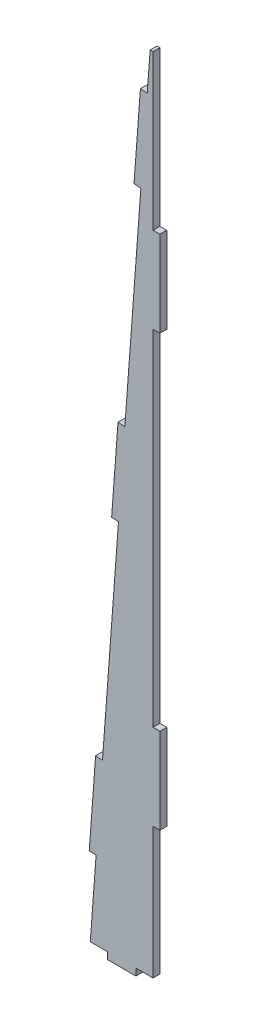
ISO-10303-21;
HEADER;
FILE_DESCRIPTION(('STEP AP214'),'2;1');
FILE_NAME('part.step','',(''),(''),'','','');
FILE_SCHEMA(('AUTOMOTIVE_DESIGN { 1 0 10303 214 1 1 1 1 }'));
ENDSEC;
DATA;
#1=APPLICATION_CONTEXT('core data for automotive mechanical design processes');
#2=APPLICATION_PROTOCOL_DEFINITION('international standard','automotive_design',2000,#1);
#3=PRODUCT_CONTEXT('',#1,'mechanical');
#4=PRODUCT('Part','Part','',(#3));
#5=PRODUCT_RELATED_PRODUCT_CATEGORY('part','',(#4));
#6=PRODUCT_DEFINITION_FORMATION('','',#4);
#7=PRODUCT_DEFINITION_CONTEXT('part definition',#1,'design');
#8=PRODUCT_DEFINITION('design','',#6,#7);
#9=PRODUCT_DEFINITION_SHAPE('','',#8);
#10=(LENGTH_UNIT() NAMED_UNIT(*) SI_UNIT(.MILLI.,.METRE.));
#11=(NAMED_UNIT(*) PLANE_ANGLE_UNIT() SI_UNIT($,.RADIAN.));
#12=(NAMED_UNIT(*) SI_UNIT($,.STERADIAN.) SOLID_ANGLE_UNIT());
#13=UNCERTAINTY_MEASURE_WITH_UNIT(LENGTH_MEASURE(1.E-05),#10,'distance_accuracy_value','');
#14=(GEOMETRIC_REPRESENTATION_CONTEXT(3) GLOBAL_UNCERTAINTY_ASSIGNED_CONTEXT((#13)) GLOBAL_UNIT_ASSIGNED_CONTEXT((#10,
#11,#12)) REPRESENTATION_CONTEXT('',''));
#15=CARTESIAN_POINT('',(0.,0.,0.));
#16=DIRECTION('',(0.,0.,1.));
#17=DIRECTION('',(1.,0.,0.));
#18=AXIS2_PLACEMENT_3D('',#15,#16,#17);
#19=CARTESIAN_POINT('',(-1.52399999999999,179.876556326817,1.524));
#20=DIRECTION('',(-1.,0.,0.));
#21=DIRECTION('',(0.,0.,1.));
#22=AXIS2_PLACEMENT_3D('',#19,#20,#21);
#23=PLANE('',#22);
#24=DIRECTION('',(0.,1.,0.));
#25=VECTOR('',#24,1.);
#26=CARTESIAN_POINT('',(-1.52399999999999,179.876556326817,0.));
#27=LINE('',#26,#25);
#28=CARTESIAN_POINT('',(-1.52399999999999,145.513267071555,0.));
#29=VERTEX_POINT('',#28);
#30=CARTESIAN_POINT('',(-1.52399999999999,179.876556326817,0.));
#31=VERTEX_POINT('',#30);
#32=EDGE_CURVE('E252',#29,#31,#27,.T.);
#33=ORIENTED_EDGE('',*,*,#32,.T.);
#34=DIRECTION('',(0.,0.,-1.));
#35=VECTOR('',#34,1.);
#36=CARTESIAN_POINT('',(-1.52399999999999,179.876556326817,1.524));
#37=LINE('',#36,#35);
#38=CARTESIAN_POINT('',(-1.52399999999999,179.876556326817,1.524));
#39=VERTEX_POINT('',#38);
#40=EDGE_CURVE('E11',#39,#31,#37,.T.);
#41=ORIENTED_EDGE('',*,*,#40,.F.);
#42=DIRECTION('',(0.,1.,0.));
#43=VECTOR('',#42,1.);
#44=CARTESIAN_POINT('',(-1.52399999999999,179.876556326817,1.524));
#45=LINE('',#44,#43);
#46=CARTESIAN_POINT('',(-1.52399999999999,145.513267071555,1.524));
#47=VERTEX_POINT('',#46);
#48=EDGE_CURVE('E306',#47,#39,#45,.T.);
#49=ORIENTED_EDGE('',*,*,#48,.F.);
#50=DIRECTION('',(0.,0.,-1.));
#51=VECTOR('',#50,1.);
#52=CARTESIAN_POINT('',(-1.52399999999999,145.513267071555,1.524));
#53=LINE('',#52,#51);
#54=EDGE_CURVE('E248',#47,#29,#53,.T.);
#55=ORIENTED_EDGE('',*,*,#54,.T.);
#56=EDGE_LOOP('',(#33,#41,#49,#55));
#57=FACE_BOUND('',#56,.T.);
#58=ADVANCED_FACE('F36',(#57),#23,.F.);
#59=CARTESIAN_POINT('',(-2.16867137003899,179.876556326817,1.524));
#60=DIRECTION('',(0.,-1.,0.));
#61=DIRECTION('',(0.,0.,-1.));
#62=AXIS2_PLACEMENT_3D('',#59,#60,#61);
#63=PLANE('',#62);
#64=DIRECTION('',(-1.,0.,0.));
#65=VECTOR('',#64,1.);
#66=CARTESIAN_POINT('',(-2.16867137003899,179.876556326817,0.));
#67=LINE('',#66,#65);
#68=CARTESIAN_POINT('',(-2.16867137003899,179.876556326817,0.));
#69=VERTEX_POINT('',#68);
#70=EDGE_CURVE('E255',#31,#69,#67,.T.);
#71=ORIENTED_EDGE('',*,*,#70,.T.);
#72=DIRECTION('',(0.,0.,-1.));
#73=VECTOR('',#72,1.);
#74=CARTESIAN_POINT('',(-2.16867137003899,179.876556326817,1.524));
#75=LINE('',#74,#73);
#76=CARTESIAN_POINT('',(-2.16867137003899,179.876556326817,1.524));
#77=VERTEX_POINT('',#76);
#78=EDGE_CURVE('E44',#77,#69,#75,.T.);
#79=ORIENTED_EDGE('',*,*,#78,.F.);
#80=DIRECTION('',(-1.,0.,0.));
#81=VECTOR('',#80,1.);
#82=CARTESIAN_POINT('',(-2.16867137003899,179.876556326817,1.524));
#83=LINE('',#82,#81);
#84=EDGE_CURVE('E155',#39,#77,#83,.T.);
#85=ORIENTED_EDGE('',*,*,#84,.F.);
#86=ORIENTED_EDGE('',*,*,#40,.T.);
#87=EDGE_LOOP('',(#71,#79,#85,#86));
#88=FACE_BOUND('',#87,.T.);
#89=ADVANCED_FACE('F464',(#88),#63,.F.);
#90=CARTESIAN_POINT('',(-2.813342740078,171.236165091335,1.524));
#91=DIRECTION('',(0.997228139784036,-0.0744045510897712,0.));
#92=DIRECTION('',(0.0744045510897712,0.997228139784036,0.));
#93=AXIS2_PLACEMENT_3D('',#90,#91,#92);
#94=PLANE('',#93);
#95=DIRECTION('',(-0.0744045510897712,-0.997228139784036,0.));
#96=VECTOR('',#95,1.);
#97=CARTESIAN_POINT('',(-2.813342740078,171.236165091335,0.));
#98=LINE('',#97,#96);
#99=CARTESIAN_POINT('',(-2.813342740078,171.236165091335,0.));
#100=VERTEX_POINT('',#99);
#101=EDGE_CURVE('E257',#69,#100,#98,.T.);
#102=ORIENTED_EDGE('',*,*,#101,.T.);
#103=DIRECTION('',(0.,0.,-1.));
#104=VECTOR('',#103,1.);
#105=CARTESIAN_POINT('',(-2.813342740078,171.236165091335,1.524));
#106=LINE('',#105,#104);
#107=CARTESIAN_POINT('',(-2.813342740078,171.236165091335,1.524));
#108=VERTEX_POINT('',#107);
#109=EDGE_CURVE('E373',#108,#100,#106,.T.);
#110=ORIENTED_EDGE('',*,*,#109,.F.);
#111=DIRECTION('',(-0.0744045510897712,-0.997228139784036,0.));
#112=VECTOR('',#111,1.);
#113=CARTESIAN_POINT('',(-2.813342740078,171.236165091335,1.524));
#114=LINE('',#113,#112);
#115=EDGE_CURVE('E381',#77,#108,#114,.T.);
#116=ORIENTED_EDGE('',*,*,#115,.F.);
#117=ORIENTED_EDGE('',*,*,#78,.T.);
#118=EDGE_LOOP('',(#102,#110,#116,#117));
#119=FACE_BOUND('',#118,.T.);
#120=ADVANCED_FACE('F379',(#119),#94,.F.);
#121=CARTESIAN_POINT('',(-2.813342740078,171.236165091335,1.524));
#122=DIRECTION('',(-0.0744045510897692,-0.997228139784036,0.));
#123=DIRECTION('',(0.997228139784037,-0.0744045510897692,0.));
#124=AXIS2_PLACEMENT_3D('',#121,#122,#123);
#125=PLANE('',#124);
#126=DIRECTION('',(-0.997228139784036,0.0744045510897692,0.));
#127=VECTOR('',#126,1.);
#128=CARTESIAN_POINT('',(-2.813342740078,171.236165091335,0.));
#129=LINE('',#128,#127);
#130=CARTESIAN_POINT('',(-4.33311842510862,171.349557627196,0.));
#131=VERTEX_POINT('',#130);
#132=EDGE_CURVE('E259',#100,#131,#129,.T.);
#133=ORIENTED_EDGE('',*,*,#132,.T.);
#134=DIRECTION('',(0.,0.,-1.));
#135=VECTOR('',#134,1.);
#136=CARTESIAN_POINT('',(-4.33311842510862,171.349557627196,1.524));
#137=LINE('',#136,#135);
#138=CARTESIAN_POINT('',(-4.33311842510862,171.349557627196,1.524));
#139=VERTEX_POINT('',#138);
#140=EDGE_CURVE('E370',#139,#131,#137,.T.);
#141=ORIENTED_EDGE('',*,*,#140,.F.);
#142=DIRECTION('',(-0.997228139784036,0.0744045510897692,0.));
#143=VECTOR('',#142,1.);
#144=CARTESIAN_POINT('',(-2.813342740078,171.236165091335,1.524));
#145=LINE('',#144,#143);
#146=EDGE_CURVE('E399',#108,#139,#145,.T.);
#147=ORIENTED_EDGE('',*,*,#146,.F.);
#148=ORIENTED_EDGE('',*,*,#109,.T.);
#149=EDGE_LOOP('',(#133,#141,#147,#148));
#150=FACE_BOUND('',#149,.T.);
#151=ADVANCED_FACE('F390',(#150),#125,.F.);
#152=CARTESIAN_POINT('',(-5.75052512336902,152.35236156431,1.524));
#153=DIRECTION('',(0.997228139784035,-0.0744045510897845,0.));
#154=DIRECTION('',(0.0744045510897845,0.997228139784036,0.));
#155=AXIS2_PLACEMENT_3D('',#152,#153,#154);
#156=PLANE('',#155);
#157=DIRECTION('',(-0.0744045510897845,-0.997228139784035,0.));
#158=VECTOR('',#157,1.);
#159=CARTESIAN_POINT('',(-5.75052512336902,152.35236156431,0.));
#160=LINE('',#159,#158);
#161=CARTESIAN_POINT('',(-5.75052512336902,152.35236156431,0.));
#162=VERTEX_POINT('',#161);
#163=EDGE_CURVE('E261',#131,#162,#160,.T.);
#164=ORIENTED_EDGE('',*,*,#163,.T.);
#165=DIRECTION('',(0.,0.,-1.));
#166=VECTOR('',#165,1.);
#167=CARTESIAN_POINT('',(-5.75052512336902,152.35236156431,1.524));
#168=LINE('',#167,#166);
#169=CARTESIAN_POINT('',(-5.75052512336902,152.35236156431,1.524));
#170=VERTEX_POINT('',#169);
#171=EDGE_CURVE('E367',#170,#162,#168,.T.);
#172=ORIENTED_EDGE('',*,*,#171,.F.);
#173=DIRECTION('',(-0.0744045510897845,-0.997228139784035,0.));
#174=VECTOR('',#173,1.);
#175=CARTESIAN_POINT('',(-5.75052512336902,152.35236156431,1.524));
#176=LINE('',#175,#174);
#177=EDGE_CURVE('E396',#139,#170,#176,.T.);
#178=ORIENTED_EDGE('',*,*,#177,.F.);
#179=ORIENTED_EDGE('',*,*,#140,.T.);
#180=EDGE_LOOP('',(#164,#172,#178,#179));
#181=FACE_BOUND('',#180,.T.);
#182=ADVANCED_FACE('F394',(#181),#156,.F.);
#183=CARTESIAN_POINT('',(-4.23074943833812,152.238969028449,1.524));
#184=DIRECTION('',(0.0744045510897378,0.997228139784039,0.));
#185=DIRECTION('',(-0.997228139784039,0.0744045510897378,0.));
#186=AXIS2_PLACEMENT_3D('',#183,#184,#185);
#187=PLANE('',#186);
#188=DIRECTION('',(0.997228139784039,-0.0744045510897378,0.));
#189=VECTOR('',#188,1.);
#190=CARTESIAN_POINT('',(-4.23074943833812,152.238969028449,0.));
#191=LINE('',#190,#189);
#192=CARTESIAN_POINT('',(-4.23074943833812,152.238969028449,0.));
#193=VERTEX_POINT('',#192);
#194=EDGE_CURVE('E263',#162,#193,#191,.T.);
#195=ORIENTED_EDGE('',*,*,#194,.T.);
#196=DIRECTION('',(0.,0.,-1.));
#197=VECTOR('',#196,1.);
#198=CARTESIAN_POINT('',(-4.23074943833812,152.238969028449,1.524));
#199=LINE('',#198,#197);
#200=CARTESIAN_POINT('',(-4.23074943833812,152.238969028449,1.524));
#201=VERTEX_POINT('',#200);
#202=EDGE_CURVE('E364',#201,#193,#199,.T.);
#203=ORIENTED_EDGE('',*,*,#202,.F.);
#204=DIRECTION('',(0.997228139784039,-0.0744045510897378,0.));
#205=VECTOR('',#204,1.);
#206=CARTESIAN_POINT('',(-4.23074943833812,152.238969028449,1.524));
#207=LINE('',#206,#205);
#208=EDGE_CURVE('E398',#170,#201,#207,.T.);
#209=ORIENTED_EDGE('',*,*,#208,.F.);
#210=ORIENTED_EDGE('',*,*,#171,.T.);
#211=EDGE_LOOP('',(#195,#203,#209,#210));
#212=FACE_BOUND('',#211,.T.);
#213=ADVANCED_FACE('F477',(#212),#187,.F.);
#214=CARTESIAN_POINT('',(-7.78613110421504,104.586955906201,1.524));
#215=DIRECTION('',(0.997228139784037,-0.0744045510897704,0.));
#216=DIRECTION('',(0.0744045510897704,0.997228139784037,0.));
#217=AXIS2_PLACEMENT_3D('',#214,#215,#216);
#218=PLANE('',#217);
#219=DIRECTION('',(-0.0744045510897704,-0.997228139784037,0.));
#220=VECTOR('',#219,1.);
#221=CARTESIAN_POINT('',(-7.78613110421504,104.586955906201,0.));
#222=LINE('',#221,#220);
#223=CARTESIAN_POINT('',(-7.78613110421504,104.586955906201,0.));
#224=VERTEX_POINT('',#223);
#225=EDGE_CURVE('E265',#193,#224,#222,.T.);
#226=ORIENTED_EDGE('',*,*,#225,.T.);
#227=DIRECTION('',(0.,0.,-1.));
#228=VECTOR('',#227,1.);
#229=CARTESIAN_POINT('',(-7.78613110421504,104.586955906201,1.524));
#230=LINE('',#229,#228);
#231=CARTESIAN_POINT('',(-7.78613110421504,104.586955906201,1.524));
#232=VERTEX_POINT('',#231);
#233=EDGE_CURVE('E361',#232,#224,#230,.T.);
#234=ORIENTED_EDGE('',*,*,#233,.F.);
#235=DIRECTION('',(-0.0744045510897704,-0.997228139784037,0.));
#236=VECTOR('',#235,1.);
#237=CARTESIAN_POINT('',(-7.78613110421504,104.586955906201,1.524));
#238=LINE('',#237,#236);
#239=EDGE_CURVE('E401',#201,#232,#238,.T.);
#240=ORIENTED_EDGE('',*,*,#239,.F.);
#241=ORIENTED_EDGE('',*,*,#202,.T.);
#242=EDGE_LOOP('',(#226,#234,#240,#241));
#243=FACE_BOUND('',#242,.T.);
#244=ADVANCED_FACE('F480',(#243),#218,.F.);
#245=CARTESIAN_POINT('',(-7.78613110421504,104.586955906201,1.524));
#246=DIRECTION('',(-0.0744045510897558,-0.997228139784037,0.));
#247=DIRECTION('',(0.997228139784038,-0.0744045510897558,0.));
#248=AXIS2_PLACEMENT_3D('',#245,#246,#247);
#249=PLANE('',#248);
#250=DIRECTION('',(-0.997228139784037,0.0744045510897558,0.));
#251=VECTOR('',#250,1.);
#252=CARTESIAN_POINT('',(-7.78613110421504,104.586955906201,0.));
#253=LINE('',#252,#251);
#254=CARTESIAN_POINT('',(-9.30590678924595,104.700348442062,0.));
#255=VERTEX_POINT('',#254);
#256=EDGE_CURVE('E267',#224,#255,#253,.T.);
#257=ORIENTED_EDGE('',*,*,#256,.T.);
#258=DIRECTION('',(0.,0.,-1.));
#259=VECTOR('',#258,1.);
#260=CARTESIAN_POINT('',(-9.30590678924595,104.700348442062,1.524));
#261=LINE('',#260,#259);
#262=CARTESIAN_POINT('',(-9.30590678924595,104.700348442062,1.524));
#263=VERTEX_POINT('',#262);
#264=EDGE_CURVE('E358',#263,#255,#261,.T.);
#265=ORIENTED_EDGE('',*,*,#264,.F.);
#266=DIRECTION('',(-0.997228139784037,0.0744045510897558,0.));
#267=VECTOR('',#266,1.);
#268=CARTESIAN_POINT('',(-7.78613110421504,104.586955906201,1.524));
#269=LINE('',#268,#267);
#270=EDGE_CURVE('E407',#232,#263,#269,.T.);
#271=ORIENTED_EDGE('',*,*,#270,.F.);
#272=ORIENTED_EDGE('',*,*,#233,.T.);
#273=EDGE_LOOP('',(#257,#265,#271,#272));
#274=FACE_BOUND('',#273,.T.);
#275=ADVANCED_FACE('F484',(#274),#249,.F.);
#276=CARTESIAN_POINT('',(-9.30590678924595,104.700348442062,1.524));
#277=DIRECTION('',(0.997228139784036,-0.0744045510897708,0.));
#278=DIRECTION('',(0.0744045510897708,0.997228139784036,0.));
#279=AXIS2_PLACEMENT_3D('',#276,#277,#278);
#280=PLANE('',#279);
#281=DIRECTION('',(-0.0744045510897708,-0.997228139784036,0.));
#282=VECTOR('',#281,1.);
#283=CARTESIAN_POINT('',(-9.30590678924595,104.700348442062,0.));
#284=LINE('',#283,#282);
#285=CARTESIAN_POINT('',(-10.7233134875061,85.7031523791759,0.));
#286=VERTEX_POINT('',#285);
#287=EDGE_CURVE('E269',#255,#286,#284,.T.);
#288=ORIENTED_EDGE('',*,*,#287,.T.);
#289=DIRECTION('',(0.,0.,-1.));
#290=VECTOR('',#289,1.);
#291=CARTESIAN_POINT('',(-10.7233134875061,85.7031523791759,1.524));
#292=LINE('',#291,#290);
#293=CARTESIAN_POINT('',(-10.7233134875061,85.7031523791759,1.524));
#294=VERTEX_POINT('',#293);
#295=EDGE_CURVE('E355',#294,#286,#292,.T.);
#296=ORIENTED_EDGE('',*,*,#295,.F.);
#297=DIRECTION('',(-0.0744045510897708,-0.997228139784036,0.));
#298=VECTOR('',#297,1.);
#299=CARTESIAN_POINT('',(-9.30590678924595,104.700348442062,1.524));
#300=LINE('',#299,#298);
#301=EDGE_CURVE('E409',#263,#294,#300,.T.);
#302=ORIENTED_EDGE('',*,*,#301,.F.);
#303=ORIENTED_EDGE('',*,*,#264,.T.);
#304=EDGE_LOOP('',(#288,#296,#302,#303));
#305=FACE_BOUND('',#304,.T.);
#306=ADVANCED_FACE('F488',(#305),#280,.F.);
#307=CARTESIAN_POINT('',(-9.20353780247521,85.5897598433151,1.524));
#308=DIRECTION('',(0.0744045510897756,0.997228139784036,0.));
#309=DIRECTION('',(-0.997228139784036,0.0744045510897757,0.));
#310=AXIS2_PLACEMENT_3D('',#307,#308,#309);
#311=PLANE('',#310);
#312=DIRECTION('',(0.997228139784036,-0.0744045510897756,0.));
#313=VECTOR('',#312,1.);
#314=CARTESIAN_POINT('',(-9.20353780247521,85.5897598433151,0.));
#315=LINE('',#314,#313);
#316=CARTESIAN_POINT('',(-9.20353780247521,85.5897598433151,0.));
#317=VERTEX_POINT('',#316);
#318=EDGE_CURVE('E271',#286,#317,#315,.T.);
#319=ORIENTED_EDGE('',*,*,#318,.T.);
#320=DIRECTION('',(0.,0.,-1.));
#321=VECTOR('',#320,1.);
#322=CARTESIAN_POINT('',(-9.20353780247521,85.5897598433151,1.524));
#323=LINE('',#322,#321);
#324=CARTESIAN_POINT('',(-9.20353780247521,85.5897598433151,1.524));
#325=VERTEX_POINT('',#324);
#326=EDGE_CURVE('E352',#325,#317,#323,.T.);
#327=ORIENTED_EDGE('',*,*,#326,.F.);
#328=DIRECTION('',(0.997228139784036,-0.0744045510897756,0.));
#329=VECTOR('',#328,1.);
#330=CARTESIAN_POINT('',(-9.20353780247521,85.5897598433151,1.524));
#331=LINE('',#330,#329);
#332=EDGE_CURVE('E411',#294,#325,#331,.T.);
#333=ORIENTED_EDGE('',*,*,#332,.F.);
#334=ORIENTED_EDGE('',*,*,#295,.T.);
#335=EDGE_LOOP('',(#319,#327,#333,#334));
#336=FACE_BOUND('',#335,.T.);
#337=ADVANCED_FACE('F492',(#336),#311,.F.);
#338=CARTESIAN_POINT('',(-12.7589194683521,37.9377467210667,1.524));
#339=DIRECTION('',(0.997228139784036,-0.0744045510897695,0.));
#340=DIRECTION('',(0.0744045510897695,0.997228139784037,0.));
#341=AXIS2_PLACEMENT_3D('',#338,#339,#340);
#342=PLANE('',#341);
#343=DIRECTION('',(-0.0744045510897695,-0.997228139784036,0.));
#344=VECTOR('',#343,1.);
#345=CARTESIAN_POINT('',(-12.7589194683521,37.9377467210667,0.));
#346=LINE('',#345,#344);
#347=CARTESIAN_POINT('',(-12.7589194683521,37.9377467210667,0.));
#348=VERTEX_POINT('',#347);
#349=EDGE_CURVE('E273',#317,#348,#346,.T.);
#350=ORIENTED_EDGE('',*,*,#349,.T.);
#351=DIRECTION('',(0.,0.,-1.));
#352=VECTOR('',#351,1.);
#353=CARTESIAN_POINT('',(-12.7589194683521,37.9377467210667,1.524));
#354=LINE('',#353,#352);
#355=CARTESIAN_POINT('',(-12.7589194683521,37.9377467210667,1.524));
#356=VERTEX_POINT('',#355);
#357=EDGE_CURVE('E349',#356,#348,#354,.T.);
#358=ORIENTED_EDGE('',*,*,#357,.F.);
#359=DIRECTION('',(-0.0744045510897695,-0.997228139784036,0.));
#360=VECTOR('',#359,1.);
#361=CARTESIAN_POINT('',(-12.7589194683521,37.9377467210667,1.524));
#362=LINE('',#361,#360);
#363=EDGE_CURVE('E413',#325,#356,#362,.T.);
#364=ORIENTED_EDGE('',*,*,#363,.F.);
#365=ORIENTED_EDGE('',*,*,#326,.T.);
#366=EDGE_LOOP('',(#350,#358,#364,#365));
#367=FACE_BOUND('',#366,.T.);
#368=ADVANCED_FACE('F496',(#367),#342,.F.);
#369=CARTESIAN_POINT('',(-12.7589194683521,37.9377467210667,1.524));
#370=DIRECTION('',(-0.0744045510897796,-0.997228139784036,0.));
#371=DIRECTION('',(0.997228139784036,-0.0744045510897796,0.));
#372=AXIS2_PLACEMENT_3D('',#369,#370,#371);
#373=PLANE('',#372);
#374=DIRECTION('',(-0.997228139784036,0.0744045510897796,0.));
#375=VECTOR('',#374,1.);
#376=CARTESIAN_POINT('',(-12.7589194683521,37.9377467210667,0.));
#377=LINE('',#376,#375);
#378=CARTESIAN_POINT('',(-14.2786951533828,38.0511392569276,0.));
#379=VERTEX_POINT('',#378);
#380=EDGE_CURVE('E275',#348,#379,#377,.T.);
#381=ORIENTED_EDGE('',*,*,#380,.T.);
#382=DIRECTION('',(0.,0.,-1.));
#383=VECTOR('',#382,1.);
#384=CARTESIAN_POINT('',(-14.2786951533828,38.0511392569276,1.524));
#385=LINE('',#384,#383);
#386=CARTESIAN_POINT('',(-14.2786951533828,38.0511392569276,1.524));
#387=VERTEX_POINT('',#386);
#388=EDGE_CURVE('E346',#387,#379,#385,.T.);
#389=ORIENTED_EDGE('',*,*,#388,.F.);
#390=DIRECTION('',(-0.997228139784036,0.0744045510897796,0.));
#391=VECTOR('',#390,1.);
#392=CARTESIAN_POINT('',(-12.7589194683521,37.9377467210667,1.524));
#393=LINE('',#392,#391);
#394=EDGE_CURVE('E415',#356,#387,#393,.T.);
#395=ORIENTED_EDGE('',*,*,#394,.F.);
#396=ORIENTED_EDGE('',*,*,#357,.T.);
#397=EDGE_LOOP('',(#381,#389,#395,#396));
#398=FACE_BOUND('',#397,.T.);
#399=ADVANCED_FACE('F500',(#398),#373,.F.);
#400=CARTESIAN_POINT('',(-14.2786951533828,38.0511392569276,1.524));
#401=DIRECTION('',(0.997228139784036,-0.0744045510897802,0.));
#402=DIRECTION('',(0.0744045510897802,0.997228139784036,0.));
#403=AXIS2_PLACEMENT_3D('',#400,#401,#402);
#404=PLANE('',#403);
#405=DIRECTION('',(-0.0744045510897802,-0.997228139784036,0.));
#406=VECTOR('',#405,1.);
#407=CARTESIAN_POINT('',(-14.2786951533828,38.0511392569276,0.));
#408=LINE('',#407,#406);
#409=CARTESIAN_POINT('',(-15.6961018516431,19.0539431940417,0.));
#410=VERTEX_POINT('',#409);
#411=EDGE_CURVE('E277',#379,#410,#408,.T.);
#412=ORIENTED_EDGE('',*,*,#411,.T.);
#413=DIRECTION('',(0.,0.,-1.));
#414=VECTOR('',#413,1.);
#415=CARTESIAN_POINT('',(-15.6961018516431,19.0539431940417,1.524));
#416=LINE('',#415,#414);
#417=CARTESIAN_POINT('',(-15.6961018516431,19.0539431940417,1.524));
#418=VERTEX_POINT('',#417);
#419=EDGE_CURVE('E343',#418,#410,#416,.T.);
#420=ORIENTED_EDGE('',*,*,#419,.F.);
#421=DIRECTION('',(-0.0744045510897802,-0.997228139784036,0.));
#422=VECTOR('',#421,1.);
#423=CARTESIAN_POINT('',(-14.2786951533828,38.0511392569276,1.524));
#424=LINE('',#423,#422);
#425=EDGE_CURVE('E417',#387,#418,#424,.T.);
#426=ORIENTED_EDGE('',*,*,#425,.F.);
#427=ORIENTED_EDGE('',*,*,#388,.T.);
#428=EDGE_LOOP('',(#412,#420,#426,#427));
#429=FACE_BOUND('',#428,.T.);
#430=ADVANCED_FACE('F504',(#429),#404,.F.);
#431=CARTESIAN_POINT('',(-14.1763261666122,18.9405506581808,1.524));
#432=DIRECTION('',(0.0744045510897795,0.997228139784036,0.));
#433=DIRECTION('',(-0.997228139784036,0.0744045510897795,0.));
#434=AXIS2_PLACEMENT_3D('',#431,#432,#433);
#435=PLANE('',#434);
#436=DIRECTION('',(0.997228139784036,-0.0744045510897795,0.));
#437=VECTOR('',#436,1.);
#438=CARTESIAN_POINT('',(-14.1763261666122,18.9405506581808,0.));
#439=LINE('',#438,#437);
#440=CARTESIAN_POINT('',(-14.1763261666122,18.9405506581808,0.));
#441=VERTEX_POINT('',#440);
#442=EDGE_CURVE('E279',#410,#441,#439,.T.);
#443=ORIENTED_EDGE('',*,*,#442,.T.);
#444=DIRECTION('',(0.,0.,-1.));
#445=VECTOR('',#444,1.);
#446=CARTESIAN_POINT('',(-14.1763261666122,18.9405506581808,1.524));
#447=LINE('',#446,#445);
#448=CARTESIAN_POINT('',(-14.1763261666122,18.9405506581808,1.524));
#449=VERTEX_POINT('',#448);
#450=EDGE_CURVE('E340',#449,#441,#447,.T.);
#451=ORIENTED_EDGE('',*,*,#450,.F.);
#452=DIRECTION('',(0.997228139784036,-0.0744045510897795,0.));
#453=VECTOR('',#452,1.);
#454=CARTESIAN_POINT('',(-14.1763261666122,18.9405506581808,1.524));
#455=LINE('',#454,#453);
#456=EDGE_CURVE('E419',#418,#449,#455,.T.);
#457=ORIENTED_EDGE('',*,*,#456,.F.);
#458=ORIENTED_EDGE('',*,*,#419,.T.);
#459=EDGE_LOOP('',(#443,#451,#457,#458));
#460=FACE_BOUND('',#459,.T.);
#461=ADVANCED_FACE('F508',(#460),#435,.F.);
#462=CARTESIAN_POINT('',(-15.4656689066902,1.65976818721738,1.524));
#463=DIRECTION('',(0.997228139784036,-0.0744045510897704,0.));
#464=DIRECTION('',(0.0744045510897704,0.997228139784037,0.));
#465=AXIS2_PLACEMENT_3D('',#462,#463,#464);
#466=PLANE('',#465);
#467=DIRECTION('',(-0.0744045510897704,-0.997228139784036,0.));
#468=VECTOR('',#467,1.);
#469=CARTESIAN_POINT('',(-15.4656689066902,1.65976818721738,0.));
#470=LINE('',#469,#468);
#471=CARTESIAN_POINT('',(-15.4656689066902,1.65976818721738,0.));
#472=VERTEX_POINT('',#471);
#473=EDGE_CURVE('E281',#441,#472,#470,.T.);
#474=ORIENTED_EDGE('',*,*,#473,.T.);
#475=DIRECTION('',(0.,0.,-1.));
#476=VECTOR('',#475,1.);
#477=CARTESIAN_POINT('',(-15.4656689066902,1.65976818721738,1.524));
#478=LINE('',#477,#476);
#479=CARTESIAN_POINT('',(-15.4656689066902,1.65976818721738,1.524));
#480=VERTEX_POINT('',#479);
#481=EDGE_CURVE('E337',#480,#472,#478,.T.);
#482=ORIENTED_EDGE('',*,*,#481,.F.);
#483=DIRECTION('',(-0.0744045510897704,-0.997228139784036,0.));
#484=VECTOR('',#483,1.);
#485=CARTESIAN_POINT('',(-15.4656689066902,1.65976818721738,1.524));
#486=LINE('',#485,#484);
#487=EDGE_CURVE('E421',#449,#480,#486,.T.);
#488=ORIENTED_EDGE('',*,*,#487,.F.);
#489=ORIENTED_EDGE('',*,*,#450,.T.);
#490=EDGE_LOOP('',(#474,#482,#488,#489));
#491=FACE_BOUND('',#490,.T.);
#492=ADVANCED_FACE('F512',(#491),#466,.F.);
#493=CARTESIAN_POINT('',(-11.669834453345,1.65976818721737,1.524));
#494=DIRECTION('',(0.,1.,0.));
#495=DIRECTION('',(-1.,0.,0.));
#496=AXIS2_PLACEMENT_3D('',#493,#494,#495);
#497=PLANE('',#496);
#498=DIRECTION('',(1.,0.,0.));
#499=VECTOR('',#498,1.);
#500=CARTESIAN_POINT('',(-11.669834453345,1.65976818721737,0.));
#501=LINE('',#500,#499);
#502=CARTESIAN_POINT('',(-11.669834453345,1.65976818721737,0.));
#503=VERTEX_POINT('',#502);
#504=EDGE_CURVE('E283',#472,#503,#501,.T.);
#505=ORIENTED_EDGE('',*,*,#504,.T.);
#506=DIRECTION('',(0.,0.,-1.));
#507=VECTOR('',#506,1.);
#508=CARTESIAN_POINT('',(-11.669834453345,1.65976818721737,1.524));
#509=LINE('',#508,#507);
#510=CARTESIAN_POINT('',(-11.669834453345,1.65976818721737,1.524));
#511=VERTEX_POINT('',#510);
#512=EDGE_CURVE('E334',#511,#503,#509,.T.);
#513=ORIENTED_EDGE('',*,*,#512,.F.);
#514=DIRECTION('',(1.,0.,0.));
#515=VECTOR('',#514,1.);
#516=CARTESIAN_POINT('',(-11.669834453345,1.65976818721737,1.524));
#517=LINE('',#516,#515);
#518=EDGE_CURVE('E423',#480,#511,#517,.T.);
#519=ORIENTED_EDGE('',*,*,#518,.F.);
#520=ORIENTED_EDGE('',*,*,#481,.T.);
#521=EDGE_LOOP('',(#505,#513,#519,#520));
#522=FACE_BOUND('',#521,.T.);
#523=ADVANCED_FACE('F516',(#522),#497,.F.);
#524=CARTESIAN_POINT('',(-11.669834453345,1.65976818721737,1.524));
#525=DIRECTION('',(1.,0.,0.));
#526=DIRECTION('',(0.,0.,-1.));
#527=AXIS2_PLACEMENT_3D('',#524,#525,#526);
#528=PLANE('',#527);
#529=DIRECTION('',(0.,-1.,0.));
#530=VECTOR('',#529,1.);
#531=CARTESIAN_POINT('',(-11.669834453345,1.65976818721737,0.));
#532=LINE('',#531,#530);
#533=CARTESIAN_POINT('',(-11.669834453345,0.13576818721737,0.));
#534=VERTEX_POINT('',#533);
#535=EDGE_CURVE('E285',#503,#534,#532,.T.);
#536=ORIENTED_EDGE('',*,*,#535,.T.);
#537=DIRECTION('',(0.,0.,-1.));
#538=VECTOR('',#537,1.);
#539=CARTESIAN_POINT('',(-11.669834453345,0.13576818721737,1.524));
#540=LINE('',#539,#538);
#541=CARTESIAN_POINT('',(-11.669834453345,0.13576818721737,1.524));
#542=VERTEX_POINT('',#541);
#543=EDGE_CURVE('E331',#542,#534,#540,.T.);
#544=ORIENTED_EDGE('',*,*,#543,.F.);
#545=DIRECTION('',(0.,-1.,0.));
#546=VECTOR('',#545,1.);
#547=CARTESIAN_POINT('',(-11.669834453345,1.65976818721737,1.524));
#548=LINE('',#547,#546);
#549=EDGE_CURVE('E425',#511,#542,#548,.T.);
#550=ORIENTED_EDGE('',*,*,#549,.F.);
#551=ORIENTED_EDGE('',*,*,#512,.T.);
#552=EDGE_LOOP('',(#536,#544,#550,#551));
#553=FACE_BOUND('',#552,.T.);
#554=ADVANCED_FACE('F520',(#553),#528,.F.);
#555=CARTESIAN_POINT('',(-11.669834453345,0.13576818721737,1.524));
#556=DIRECTION('',(0.,1.,0.));
#557=DIRECTION('',(-1.,0.,0.));
#558=AXIS2_PLACEMENT_3D('',#555,#556,#557);
#559=PLANE('',#558);
#560=DIRECTION('',(1.,0.,0.));
#561=VECTOR('',#560,1.);
#562=CARTESIAN_POINT('',(-11.669834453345,0.13576818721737,0.));
#563=LINE('',#562,#561);
#564=CARTESIAN_POINT('',(-5.31983445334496,0.13576818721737,0.));
#565=VERTEX_POINT('',#564);
#566=EDGE_CURVE('E287',#534,#565,#563,.T.);
#567=ORIENTED_EDGE('',*,*,#566,.T.);
#568=DIRECTION('',(0.,0.,-1.));
#569=VECTOR('',#568,1.);
#570=CARTESIAN_POINT('',(-5.31983445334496,0.13576818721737,1.524));
#571=LINE('',#570,#569);
#572=CARTESIAN_POINT('',(-5.31983445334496,0.13576818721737,1.524));
#573=VERTEX_POINT('',#572);
#574=EDGE_CURVE('E328',#573,#565,#571,.T.);
#575=ORIENTED_EDGE('',*,*,#574,.F.);
#576=DIRECTION('',(1.,0.,0.));
#577=VECTOR('',#576,1.);
#578=CARTESIAN_POINT('',(-11.669834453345,0.13576818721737,1.524));
#579=LINE('',#578,#577);
#580=EDGE_CURVE('E427',#542,#573,#579,.T.);
#581=ORIENTED_EDGE('',*,*,#580,.F.);
#582=ORIENTED_EDGE('',*,*,#543,.T.);
#583=EDGE_LOOP('',(#567,#575,#581,#582));
#584=FACE_BOUND('',#583,.T.);
#585=ADVANCED_FACE('F524',(#584),#559,.F.);
#586=CARTESIAN_POINT('',(-5.31983445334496,1.65976818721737,1.524));
#587=DIRECTION('',(-1.,0.,0.));
#588=DIRECTION('',(0.,0.,1.));
#589=AXIS2_PLACEMENT_3D('',#586,#587,#588);
#590=PLANE('',#589);
#591=DIRECTION('',(0.,1.,0.));
#592=VECTOR('',#591,1.);
#593=CARTESIAN_POINT('',(-5.31983445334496,1.65976818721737,0.));
#594=LINE('',#593,#592);
#595=CARTESIAN_POINT('',(-5.31983445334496,1.65976818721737,0.));
#596=VERTEX_POINT('',#595);
#597=EDGE_CURVE('E289',#565,#596,#594,.T.);
#598=ORIENTED_EDGE('',*,*,#597,.T.);
#599=DIRECTION('',(0.,0.,-1.));
#600=VECTOR('',#599,1.);
#601=CARTESIAN_POINT('',(-5.31983445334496,1.65976818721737,1.524));
#602=LINE('',#601,#600);
#603=CARTESIAN_POINT('',(-5.31983445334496,1.65976818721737,1.524));
#604=VERTEX_POINT('',#603);
#605=EDGE_CURVE('E325',#604,#596,#602,.T.);
#606=ORIENTED_EDGE('',*,*,#605,.F.);
#607=DIRECTION('',(0.,1.,0.));
#608=VECTOR('',#607,1.);
#609=CARTESIAN_POINT('',(-5.31983445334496,1.65976818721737,1.524));
#610=LINE('',#609,#608);
#611=EDGE_CURVE('E429',#573,#604,#610,.T.);
#612=ORIENTED_EDGE('',*,*,#611,.F.);
#613=ORIENTED_EDGE('',*,*,#574,.T.);
#614=EDGE_LOOP('',(#598,#606,#612,#613));
#615=FACE_BOUND('',#614,.T.);
#616=ADVANCED_FACE('F528',(#615),#590,.F.);
#617=CARTESIAN_POINT('',(-1.52399999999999,1.65976818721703,1.524));
#618=DIRECTION('',(0.,1.,0.));
#619=DIRECTION('',(-1.,0.,0.));
#620=AXIS2_PLACEMENT_3D('',#617,#618,#619);
#621=PLANE('',#620);
#622=DIRECTION('',(1.,0.,0.));
#623=VECTOR('',#622,1.);
#624=CARTESIAN_POINT('',(-1.52399999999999,1.65976818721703,0.));
#625=LINE('',#624,#623);
#626=CARTESIAN_POINT('',(-1.52399999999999,1.65976818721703,0.));
#627=VERTEX_POINT('',#626);
#628=EDGE_CURVE('E291',#596,#627,#625,.T.);
#629=ORIENTED_EDGE('',*,*,#628,.T.);
#630=DIRECTION('',(0.,0.,-1.));
#631=VECTOR('',#630,1.);
#632=CARTESIAN_POINT('',(-1.52399999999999,1.65976818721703,1.524));
#633=LINE('',#632,#631);
#634=CARTESIAN_POINT('',(-1.52399999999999,1.65976818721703,1.524));
#635=VERTEX_POINT('',#634);
#636=EDGE_CURVE('E322',#635,#627,#633,.T.);
#637=ORIENTED_EDGE('',*,*,#636,.F.);
#638=DIRECTION('',(1.,0.,0.));
#639=VECTOR('',#638,1.);
#640=CARTESIAN_POINT('',(-1.52399999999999,1.65976818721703,1.524));
#641=LINE('',#640,#639);
#642=EDGE_CURVE('E431',#604,#635,#641,.T.);
#643=ORIENTED_EDGE('',*,*,#642,.F.);
#644=ORIENTED_EDGE('',*,*,#605,.T.);
#645=EDGE_LOOP('',(#629,#637,#643,#644));
#646=FACE_BOUND('',#645,.T.);
#647=ADVANCED_FACE('F532',(#646),#621,.F.);
#648=CARTESIAN_POINT('',(-1.52399999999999,30.8386863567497,1.524));
#649=DIRECTION('',(-1.,0.,0.));
#650=DIRECTION('',(0.,0.,1.));
#651=AXIS2_PLACEMENT_3D('',#648,#649,#650);
#652=PLANE('',#651);
#653=DIRECTION('',(0.,1.,0.));
#654=VECTOR('',#653,1.);
#655=CARTESIAN_POINT('',(-1.52399999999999,30.8386863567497,0.));
#656=LINE('',#655,#654);
#657=CARTESIAN_POINT('',(-1.52399999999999,30.8386863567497,0.));
#658=VERTEX_POINT('',#657);
#659=EDGE_CURVE('E293',#627,#658,#656,.T.);
#660=ORIENTED_EDGE('',*,*,#659,.T.);
#661=DIRECTION('',(0.,0.,-1.));
#662=VECTOR('',#661,1.);
#663=CARTESIAN_POINT('',(-1.52399999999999,30.8386863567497,1.524));
#664=LINE('',#663,#662);
#665=CARTESIAN_POINT('',(-1.52399999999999,30.8386863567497,1.524));
#666=VERTEX_POINT('',#665);
#667=EDGE_CURVE('E319',#666,#658,#664,.T.);
#668=ORIENTED_EDGE('',*,*,#667,.F.);
#669=DIRECTION('',(0.,1.,0.));
#670=VECTOR('',#669,1.);
#671=CARTESIAN_POINT('',(-1.52399999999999,30.8386863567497,1.524));
#672=LINE('',#671,#670);
#673=EDGE_CURVE('E433',#635,#666,#672,.T.);
#674=ORIENTED_EDGE('',*,*,#673,.F.);
#675=ORIENTED_EDGE('',*,*,#636,.T.);
#676=EDGE_LOOP('',(#660,#668,#674,#675));
#677=FACE_BOUND('',#676,.T.);
#678=ADVANCED_FACE('F536',(#677),#652,.F.);
#679=CARTESIAN_POINT('',(0.,30.8386863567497,1.524));
#680=DIRECTION('',(0.,1.,0.));
#681=DIRECTION('',(0.,0.,1.));
#682=AXIS2_PLACEMENT_3D('',#679,#680,#681);
#683=PLANE('',#682);
#684=DIRECTION('',(1.,0.,0.));
#685=VECTOR('',#684,1.);
#686=CARTESIAN_POINT('',(0.,30.8386863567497,0.));
#687=LINE('',#686,#685);
#688=CARTESIAN_POINT('',(0.,30.8386863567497,0.));
#689=VERTEX_POINT('',#688);
#690=EDGE_CURVE('E295',#658,#689,#687,.T.);
#691=ORIENTED_EDGE('',*,*,#690,.T.);
#692=DIRECTION('',(0.,0.,-1.));
#693=VECTOR('',#692,1.);
#694=CARTESIAN_POINT('',(0.,30.8386863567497,1.524));
#695=LINE('',#694,#693);
#696=CARTESIAN_POINT('',(0.,30.8386863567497,1.524));
#697=VERTEX_POINT('',#696);
#698=EDGE_CURVE('E316',#697,#689,#695,.T.);
#699=ORIENTED_EDGE('',*,*,#698,.F.);
#700=DIRECTION('',(1.,0.,0.));
#701=VECTOR('',#700,1.);
#702=CARTESIAN_POINT('',(0.,30.8386863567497,1.524));
#703=LINE('',#702,#701);
#704=EDGE_CURVE('E435',#666,#697,#703,.T.);
#705=ORIENTED_EDGE('',*,*,#704,.F.);
#706=ORIENTED_EDGE('',*,*,#667,.T.);
#707=EDGE_LOOP('',(#691,#699,#705,#706));
#708=FACE_BOUND('',#707,.T.);
#709=ADVANCED_FACE('F540',(#708),#683,.F.);
#710=CARTESIAN_POINT('',(0.,49.8886863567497,1.524));
#711=DIRECTION('',(-1.,0.,0.));
#712=DIRECTION('',(0.,0.,1.));
#713=AXIS2_PLACEMENT_3D('',#710,#711,#712);
#714=PLANE('',#713);
#715=DIRECTION('',(0.,1.,0.));
#716=VECTOR('',#715,1.);
#717=CARTESIAN_POINT('',(0.,49.8886863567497,0.));
#718=LINE('',#717,#716);
#719=CARTESIAN_POINT('',(0.,49.8886863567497,0.));
#720=VERTEX_POINT('',#719);
#721=EDGE_CURVE('E297',#689,#720,#718,.T.);
#722=ORIENTED_EDGE('',*,*,#721,.T.);
#723=DIRECTION('',(0.,0.,-1.));
#724=VECTOR('',#723,1.);
#725=CARTESIAN_POINT('',(0.,49.8886863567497,1.524));
#726=LINE('',#725,#724);
#727=CARTESIAN_POINT('',(0.,49.8886863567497,1.524));
#728=VERTEX_POINT('',#727);
#729=EDGE_CURVE('E313',#728,#720,#726,.T.);
#730=ORIENTED_EDGE('',*,*,#729,.F.);
#731=DIRECTION('',(0.,1.,0.));
#732=VECTOR('',#731,1.);
#733=CARTESIAN_POINT('',(0.,49.8886863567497,1.524));
#734=LINE('',#733,#732);
#735=EDGE_CURVE('E437',#697,#728,#734,.T.);
#736=ORIENTED_EDGE('',*,*,#735,.F.);
#737=ORIENTED_EDGE('',*,*,#698,.T.);
#738=EDGE_LOOP('',(#722,#730,#736,#737));
#739=FACE_BOUND('',#738,.T.);
#740=ADVANCED_FACE('F544',(#739),#714,.F.);
#741=CARTESIAN_POINT('',(-1.52399999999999,49.8886863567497,1.524));
#742=DIRECTION('',(0.,-1.,0.));
#743=DIRECTION('',(0.,0.,-1.));
#744=AXIS2_PLACEMENT_3D('',#741,#742,#743);
#745=PLANE('',#744);
#746=DIRECTION('',(-1.,0.,0.));
#747=VECTOR('',#746,1.);
#748=CARTESIAN_POINT('',(-1.52399999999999,49.8886863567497,0.));
#749=LINE('',#748,#747);
#750=CARTESIAN_POINT('',(-1.52399999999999,49.8886863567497,0.));
#751=VERTEX_POINT('',#750);
#752=EDGE_CURVE('E299',#720,#751,#749,.T.);
#753=ORIENTED_EDGE('',*,*,#752,.T.);
#754=DIRECTION('',(0.,0.,-1.));
#755=VECTOR('',#754,1.);
#756=CARTESIAN_POINT('',(-1.52399999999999,49.8886863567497,1.524));
#757=LINE('',#756,#755);
#758=CARTESIAN_POINT('',(-1.52399999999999,49.8886863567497,1.524));
#759=VERTEX_POINT('',#758);
#760=EDGE_CURVE('E310',#759,#751,#757,.T.);
#761=ORIENTED_EDGE('',*,*,#760,.F.);
#762=DIRECTION('',(-1.,0.,0.));
#763=VECTOR('',#762,1.);
#764=CARTESIAN_POINT('',(-1.52399999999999,49.8886863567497,1.524));
#765=LINE('',#764,#763);
#766=EDGE_CURVE('E439',#728,#759,#765,.T.);
#767=ORIENTED_EDGE('',*,*,#766,.F.);
#768=ORIENTED_EDGE('',*,*,#729,.T.);
#769=EDGE_LOOP('',(#753,#761,#767,#768));
#770=FACE_BOUND('',#769,.T.);
#771=ADVANCED_FACE('F445',(#770),#745,.F.);
#772=CARTESIAN_POINT('',(-1.52399999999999,126.463267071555,1.524));
#773=DIRECTION('',(-1.,0.,0.));
#774=DIRECTION('',(0.,0.,1.));
#775=AXIS2_PLACEMENT_3D('',#772,#773,#774);
#776=PLANE('',#775);
#777=DIRECTION('',(0.,1.,0.));
#778=VECTOR('',#777,1.);
#779=CARTESIAN_POINT('',(-1.52399999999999,126.463267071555,0.));
#780=LINE('',#779,#778);
#781=CARTESIAN_POINT('',(-1.52399999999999,126.463267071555,0.));
#782=VERTEX_POINT('',#781);
#783=EDGE_CURVE('E301',#751,#782,#780,.T.);
#784=ORIENTED_EDGE('',*,*,#783,.T.);
#785=DIRECTION('',(0.,0.,-1.));
#786=VECTOR('',#785,1.);
#787=CARTESIAN_POINT('',(-1.52399999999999,126.463267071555,1.524));
#788=LINE('',#787,#786);
#789=CARTESIAN_POINT('',(-1.52399999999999,126.463267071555,1.524));
#790=VERTEX_POINT('',#789);
#791=EDGE_CURVE('E243',#790,#782,#788,.T.);
#792=ORIENTED_EDGE('',*,*,#791,.F.);
#793=DIRECTION('',(0.,1.,0.));
#794=VECTOR('',#793,1.);
#795=CARTESIAN_POINT('',(-1.52399999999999,126.463267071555,1.524));
#796=LINE('',#795,#794);
#797=EDGE_CURVE('E234',#759,#790,#796,.T.);
#798=ORIENTED_EDGE('',*,*,#797,.F.);
#799=ORIENTED_EDGE('',*,*,#760,.T.);
#800=EDGE_LOOP('',(#784,#792,#798,#799));
#801=FACE_BOUND('',#800,.T.);
#802=ADVANCED_FACE('F449',(#801),#776,.F.);
#803=CARTESIAN_POINT('',(0.,126.463267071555,1.524));
#804=DIRECTION('',(0.,1.,0.));
#805=DIRECTION('',(0.,0.,1.));
#806=AXIS2_PLACEMENT_3D('',#803,#804,#805);
#807=PLANE('',#806);
#808=DIRECTION('',(1.,0.,0.));
#809=VECTOR('',#808,1.);
#810=CARTESIAN_POINT('',(0.,126.463267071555,0.));
#811=LINE('',#810,#809);
#812=CARTESIAN_POINT('',(0.,126.463267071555,0.));
#813=VERTEX_POINT('',#812);
#814=EDGE_CURVE('E242',#782,#813,#811,.T.);
#815=ORIENTED_EDGE('',*,*,#814,.T.);
#816=DIRECTION('',(0.,0.,-1.));
#817=VECTOR('',#816,1.);
#818=CARTESIAN_POINT('',(0.,126.463267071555,1.524));
#819=LINE('',#818,#817);
#820=CARTESIAN_POINT('',(0.,126.463267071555,1.524));
#821=VERTEX_POINT('',#820);
#822=EDGE_CURVE('E239',#821,#813,#819,.T.);
#823=ORIENTED_EDGE('',*,*,#822,.F.);
#824=DIRECTION('',(1.,0.,0.));
#825=VECTOR('',#824,1.);
#826=CARTESIAN_POINT('',(0.,126.463267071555,1.524));
#827=LINE('',#826,#825);
#828=EDGE_CURVE('E228',#790,#821,#827,.T.);
#829=ORIENTED_EDGE('',*,*,#828,.F.);
#830=ORIENTED_EDGE('',*,*,#791,.T.);
#831=EDGE_LOOP('',(#815,#823,#829,#830));
#832=FACE_BOUND('',#831,.T.);
#833=ADVANCED_FACE('F240',(#832),#807,.F.);
#834=CARTESIAN_POINT('',(0.,145.513267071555,1.524));
#835=DIRECTION('',(-1.,0.,0.));
#836=DIRECTION('',(0.,0.,1.));
#837=AXIS2_PLACEMENT_3D('',#834,#835,#836);
#838=PLANE('',#837);
#839=DIRECTION('',(0.,1.,0.));
#840=VECTOR('',#839,1.);
#841=CARTESIAN_POINT('',(0.,145.513267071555,0.));
#842=LINE('',#841,#840);
#843=CARTESIAN_POINT('',(0.,145.513267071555,0.));
#844=VERTEX_POINT('',#843);
#845=EDGE_CURVE('E141',#813,#844,#842,.T.);
#846=ORIENTED_EDGE('',*,*,#845,.T.);
#847=DIRECTION('',(0.,0.,-1.));
#848=VECTOR('',#847,1.);
#849=CARTESIAN_POINT('',(0.,145.513267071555,1.524));
#850=LINE('',#849,#848);
#851=CARTESIAN_POINT('',(0.,145.513267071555,1.524));
#852=VERTEX_POINT('',#851);
#853=EDGE_CURVE('E244',#852,#844,#850,.T.);
#854=ORIENTED_EDGE('',*,*,#853,.F.);
#855=DIRECTION('',(0.,1.,0.));
#856=VECTOR('',#855,1.);
#857=CARTESIAN_POINT('',(0.,145.513267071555,1.524));
#858=LINE('',#857,#856);
#859=EDGE_CURVE('E232',#821,#852,#858,.T.);
#860=ORIENTED_EDGE('',*,*,#859,.F.);
#861=ORIENTED_EDGE('',*,*,#822,.T.);
#862=EDGE_LOOP('',(#846,#854,#860,#861));
#863=FACE_BOUND('',#862,.T.);
#864=ADVANCED_FACE('F246',(#863),#838,.F.);
#865=CARTESIAN_POINT('',(-1.52399999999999,145.513267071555,1.524));
#866=DIRECTION('',(0.,-1.,0.));
#867=DIRECTION('',(0.,0.,-1.));
#868=AXIS2_PLACEMENT_3D('',#865,#866,#867);
#869=PLANE('',#868);
#870=DIRECTION('',(-1.,0.,0.));
#871=VECTOR('',#870,1.);
#872=CARTESIAN_POINT('',(-1.52399999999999,145.513267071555,0.));
#873=LINE('',#872,#871);
#874=EDGE_CURVE('E147',#844,#29,#873,.T.);
#875=ORIENTED_EDGE('',*,*,#874,.T.);
#876=ORIENTED_EDGE('',*,*,#54,.F.);
#877=DIRECTION('',(-1.,0.,0.));
#878=VECTOR('',#877,1.);
#879=CARTESIAN_POINT('',(-1.52399999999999,145.513267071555,1.524));
#880=LINE('',#879,#878);
#881=EDGE_CURVE('E52',#852,#47,#880,.T.);
#882=ORIENTED_EDGE('',*,*,#881,.F.);
#883=ORIENTED_EDGE('',*,*,#853,.T.);
#884=EDGE_LOOP('',(#875,#876,#882,#883));
#885=FACE_BOUND('',#884,.T.);
#886=ADVANCED_FACE('F453',(#885),#869,.F.);
#887=CARTESIAN_POINT('',(0.,0.,1.524));
#888=DIRECTION('',(0.,0.,1.));
#889=DIRECTION('',(1.,0.,0.));
#890=AXIS2_PLACEMENT_3D('',#887,#888,#889);
#891=PLANE('',#890);
#892=ORIENTED_EDGE('',*,*,#48,.T.);
#893=ORIENTED_EDGE('',*,*,#84,.T.);
#894=ORIENTED_EDGE('',*,*,#115,.T.);
#895=ORIENTED_EDGE('',*,*,#146,.T.);
#896=ORIENTED_EDGE('',*,*,#177,.T.);
#897=ORIENTED_EDGE('',*,*,#208,.T.);
#898=ORIENTED_EDGE('',*,*,#239,.T.);
#899=ORIENTED_EDGE('',*,*,#270,.T.);
#900=ORIENTED_EDGE('',*,*,#301,.T.);
#901=ORIENTED_EDGE('',*,*,#332,.T.);
#902=ORIENTED_EDGE('',*,*,#363,.T.);
#903=ORIENTED_EDGE('',*,*,#394,.T.);
#904=ORIENTED_EDGE('',*,*,#425,.T.);
#905=ORIENTED_EDGE('',*,*,#456,.T.);
#906=ORIENTED_EDGE('',*,*,#487,.T.);
#907=ORIENTED_EDGE('',*,*,#518,.T.);
#908=ORIENTED_EDGE('',*,*,#549,.T.);
#909=ORIENTED_EDGE('',*,*,#580,.T.);
#910=ORIENTED_EDGE('',*,*,#611,.T.);
#911=ORIENTED_EDGE('',*,*,#642,.T.);
#912=ORIENTED_EDGE('',*,*,#673,.T.);
#913=ORIENTED_EDGE('',*,*,#704,.T.);
#914=ORIENTED_EDGE('',*,*,#735,.T.);
#915=ORIENTED_EDGE('',*,*,#766,.T.);
#916=ORIENTED_EDGE('',*,*,#797,.T.);
#917=ORIENTED_EDGE('',*,*,#828,.T.);
#918=ORIENTED_EDGE('',*,*,#859,.T.);
#919=ORIENTED_EDGE('',*,*,#881,.T.);
#920=EDGE_LOOP('',(#892,#893,#894,#895,#896,#897,#898,#899,#900,#901,#902,#903,#904,#905,#906,
#907,#908,#909,#910,#911,#912,#913,#914,#915,#916,#917,#918,#919));
#921=FACE_BOUND('',#920,.T.);
#922=ADVANCED_FACE('F230',(#921),#891,.T.);
#923=CARTESIAN_POINT('',(0.,0.,0.));
#924=DIRECTION('',(0.,0.,1.));
#925=DIRECTION('',(1.,0.,0.));
#926=AXIS2_PLACEMENT_3D('',#923,#924,#925);
#927=PLANE('',#926);
#928=ORIENTED_EDGE('',*,*,#32,.F.);
#929=ORIENTED_EDGE('',*,*,#874,.F.);
#930=ORIENTED_EDGE('',*,*,#845,.F.);
#931=ORIENTED_EDGE('',*,*,#814,.F.);
#932=ORIENTED_EDGE('',*,*,#783,.F.);
#933=ORIENTED_EDGE('',*,*,#752,.F.);
#934=ORIENTED_EDGE('',*,*,#721,.F.);
#935=ORIENTED_EDGE('',*,*,#690,.F.);
#936=ORIENTED_EDGE('',*,*,#659,.F.);
#937=ORIENTED_EDGE('',*,*,#628,.F.);
#938=ORIENTED_EDGE('',*,*,#597,.F.);
#939=ORIENTED_EDGE('',*,*,#566,.F.);
#940=ORIENTED_EDGE('',*,*,#535,.F.);
#941=ORIENTED_EDGE('',*,*,#504,.F.);
#942=ORIENTED_EDGE('',*,*,#473,.F.);
#943=ORIENTED_EDGE('',*,*,#442,.F.);
#944=ORIENTED_EDGE('',*,*,#411,.F.);
#945=ORIENTED_EDGE('',*,*,#380,.F.);
#946=ORIENTED_EDGE('',*,*,#349,.F.);
#947=ORIENTED_EDGE('',*,*,#318,.F.);
#948=ORIENTED_EDGE('',*,*,#287,.F.);
#949=ORIENTED_EDGE('',*,*,#256,.F.);
#950=ORIENTED_EDGE('',*,*,#225,.F.);
#951=ORIENTED_EDGE('',*,*,#194,.F.);
#952=ORIENTED_EDGE('',*,*,#163,.F.);
#953=ORIENTED_EDGE('',*,*,#132,.F.);
#954=ORIENTED_EDGE('',*,*,#101,.F.);
#955=ORIENTED_EDGE('',*,*,#70,.F.);
#956=EDGE_LOOP('',(#928,#929,#930,#931,#932,#933,#934,#935,#936,#937,#938,#939,#940,#941,#942,
#943,#944,#945,#946,#947,#948,#949,#950,#951,#952,#953,#954,#955));
#957=FACE_BOUND('',#956,.T.);
#958=ADVANCED_FACE('F385',(#957),#927,.F.);
#959=CLOSED_SHELL('',(#58,#89,#120,#151,#182,#213,#244,#275,#306,#337,#368,#399,#430,#461,#492,
#523,#554,#585,#616,#647,#678,#709,#740,#771,#802,#833,#864,#886,#922,#958));
#960=MANIFOLD_SOLID_BREP('B2',#959);
#961=ADVANCED_BREP_SHAPE_REPRESENTATION('',(#18,#960),#14);
#962=SHAPE_DEFINITION_REPRESENTATION(#9,#961);
ENDSEC;
END-ISO-10303-21;
